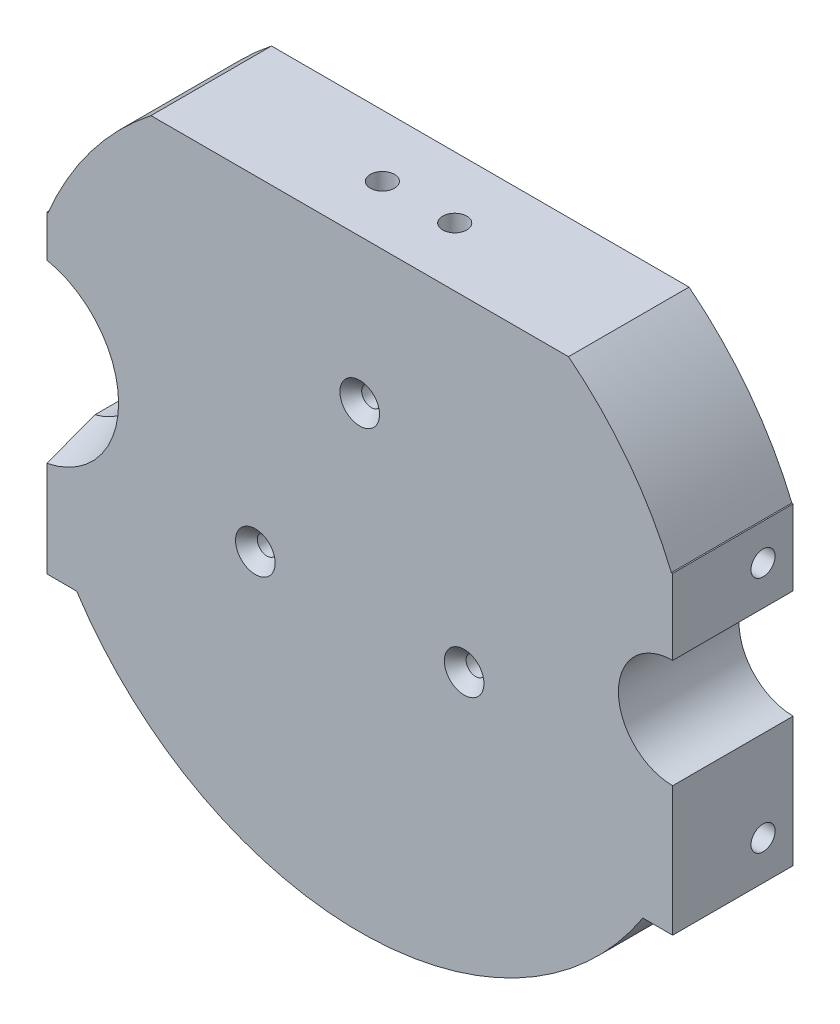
from build123d import *

# Parameters (mm, degrees)
BOSS_EXTRUDE1_DEPTH                                = 31.75
F_1_4_0_25_DIAMETER_HOLE1_D                        = 6.35
F_1_4_0_25_DIAMETER_HOLE1_DEPTH                    = 9.525
F_1_4_0_25_DIAMETER_HOLE1_TIP                      = 1.907732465
F_1_4_0_25_DIAMETER_HOLE2_D                        = 6.35
F_1_4_0_25_DIAMETER_HOLE2_DEPTH                    = 9.525
F_1_4_0_25_DIAMETER_HOLE2_TIP                      = 1.907732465
SKETCH18_W                                         = 259.381808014
SKETCH18_H                                         = 56.026213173
CUT_EXTRUDE4_DEPTH                                 = 126.31888696
CSK_FOR_10_FLAT_HEAD_SOCKET_CAP_SCREW1_D           = 5.1054
CSK_FOR_10_FLAT_HEAD_SOCKET_CAP_SCREW1_CSINK_D     = 10.4394
CSK_FOR_10_FLAT_HEAD_SOCKET_CAP_SCREW1_CSINK_ANGLE = 82
F_1_4_0_25_DIAMETER_HOLE3_D                        = 6.35
F_1_4_0_25_DIAMETER_HOLE3_DEPTH                    = 9.525
F_1_4_0_25_DIAMETER_HOLE3_TIP                      = 1.907732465
CHAMFER1_SIZE                                      = 12.7
CHAMFER1_SIZE2                                     = 4.622421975


with BuildPart() as part:
    # Sketch2 → Boss-Extrude1 (new body)
    with BuildSketch(Plane.XY):
        with BuildLine():
            Line((-82.423, -18.445083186), (-82.423, -48.4124))
            Line((-82.423, -48.4124), (-74.561716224, -48.4124))
            ThreePointArc((-74.561716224, -48.4124), (0, -88.9), (74.561716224, -48.4124))
            Line((74.561716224, -48.4124), (82.423, -48.4124))
            Line((82.423, -48.4124), (82.423, -14.3002))
            ThreePointArc((82.423, -14.3002), (68.1355, -0.0127), (82.423, 14.2748))
            Line((82.423, 14.2748), (82.423, 34.1376))
            Line((82.423, 34.1376), (82.084311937, 34.1376))
            ThreePointArc((82.084311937, 34.1376), (0, 88.9), (-82.084311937, 34.1376))
            Line((-82.084311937, 34.1376), (-82.423, 34.1376))
            Line((-82.423, 34.1376), (-82.423, 18.445083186))
            ThreePointArc((-82.423, 18.445083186), (-68.1355, 0), (-82.423, -18.445083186))
        make_face()
    extrude(amount=-BOSS_EXTRUDE1_DEPTH)

    # 1_4 _0.25_ Diameter Hole1
    with Locations(Plane(origin=(82.423, 0, 0), x_dir=(0, 0, -1), z_dir=(1, 0, 0))):
        with Locations((23.8125, 24.6126), (23.8125, -38.1)):
            Hole(F_1_4_0_25_DIAMETER_HOLE1_D / 2, depth=F_1_4_0_25_DIAMETER_HOLE1_DEPTH)
            with Locations((0, 0, -(F_1_4_0_25_DIAMETER_HOLE1_DEPTH + F_1_4_0_25_DIAMETER_HOLE1_TIP / 2))):  # 118° drill point
                Cone(0, F_1_4_0_25_DIAMETER_HOLE1_D / 2, F_1_4_0_25_DIAMETER_HOLE1_TIP, mode=Mode.SUBTRACT)

    # 1_4 _0.25_ Diameter Hole2
    with Locations(Plane.ZY.offset(82.423)):
        with Locations((-23.8125, -38.1), (-23.8125, 24.6126)):
            Hole(F_1_4_0_25_DIAMETER_HOLE2_D / 2, depth=F_1_4_0_25_DIAMETER_HOLE2_DEPTH)
            with Locations((0, 0, -(F_1_4_0_25_DIAMETER_HOLE2_DEPTH + F_1_4_0_25_DIAMETER_HOLE2_TIP / 2))):  # 118° drill point
                Cone(0, F_1_4_0_25_DIAMETER_HOLE2_D / 2, F_1_4_0_25_DIAMETER_HOLE2_TIP, mode=Mode.SUBTRACT)

    # Sketch18 → Cut-Extrude4 (cut, through all)
    with BuildSketch(Plane.XY):
        with Locations((-2.215172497, 97.863106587)):
            Rectangle(SKETCH18_W, SKETCH18_H)
    extrude(amount=-CUT_EXTRUDE4_DEPTH, mode=Mode.SUBTRACT)

    # CSK for _10 Flat Head Socket Cap Screw1 (through all)
    with Locations(Plane(origin=(64.869563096, 88.32311221, 0), x_dir=(1, 0, 0), z_dir=(0, 0, 1))):
        with Locations((-64.869563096, -56.57311221), (-37.373256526, -104.19811221), (-92.365869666, -104.19811221)):
            CounterSinkHole(CSK_FOR_10_FLAT_HEAD_SOCKET_CAP_SCREW1_D / 2, CSK_FOR_10_FLAT_HEAD_SOCKET_CAP_SCREW1_CSINK_D / 2, counter_sink_angle=CSK_FOR_10_FLAT_HEAD_SOCKET_CAP_SCREW1_CSINK_ANGLE)

    # 1_4 _0.25_ Diameter Hole3
    with Locations(Plane(origin=(0, 69.85, 0), x_dir=(1, 0, 0), z_dir=(0, 1, 0))):
        with Locations((-9.525, 15.494), (9.525, 15.494)):
            Hole(F_1_4_0_25_DIAMETER_HOLE3_D / 2, depth=F_1_4_0_25_DIAMETER_HOLE3_DEPTH)
            with Locations((0, 0, -(F_1_4_0_25_DIAMETER_HOLE3_DEPTH + F_1_4_0_25_DIAMETER_HOLE3_TIP / 2))):  # 118° drill point
                Cone(0, F_1_4_0_25_DIAMETER_HOLE3_D / 2, F_1_4_0_25_DIAMETER_HOLE3_TIP, mode=Mode.SUBTRACT)

    # Chamfer1
    chamfer1_edges = [part.edges().sort_by_distance(p)[0] for p in [
        (-68.1355, 0, 0),
    ]]
    chamfer1_side = [part.faces().sort_by_distance(p)[0] for p in [
        (-68.1355, 0, -15.875),
    ]]
    chamfer(chamfer1_edges, length=CHAMFER1_SIZE, length2=CHAMFER1_SIZE2, reference=chamfer1_side[0])


solid = part.part
